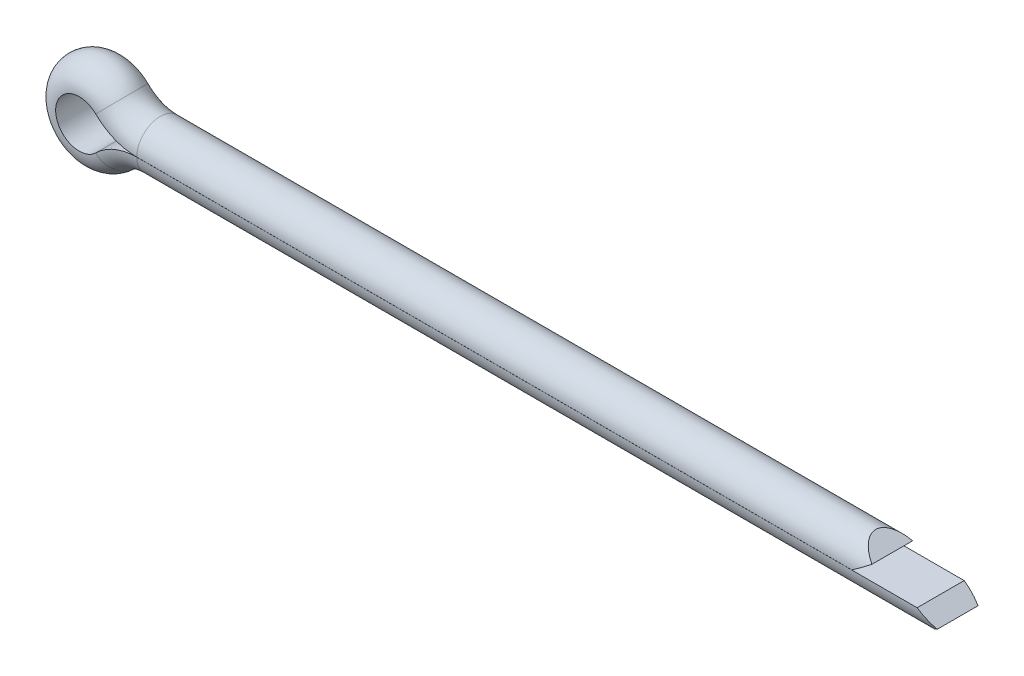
from build123d import *

# Parameters (mm, degrees)
CONECUT_DEPTH      = 31.566321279
CONECUT_DEPTH_BACK = 31.566321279


with BuildPart() as part:
    # Body: sweep along a path in PathSke
    with BuildLine(Plane.XY) as body_path:
        Line((28, 0.9), (0, 0.9))
        ThreePointArc((0, 0.9), (-0.50694731, 0.999684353), (-0.93840708, 1.283893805))
        ThreePointArc((-0.93840708, 1.283893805), (-4, 0), (-0.93840708, -1.283893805))
        ThreePointArc((-0.93840708, -1.283893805), (-0.50694731, -0.999684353), (0, -0.9))
        Line((0, -0.9), (30.5, -0.9))
    # SectionSke → Body (sweep)
    with BuildSketch(Plane(origin=(28, 0, 0), x_dir=(0, 0, -1), z_dir=(1, 0, 0))):
        with BuildLine():
            Line((-0.899997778, 0.002), (0.899997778, 0.002))
            ThreePointArc((0.899997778, 0.002), (0, 0.9), (-0.899997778, 0.002))
        make_face()
    sweep(path=body_path.line)

    # ConeCutSke → ConeCut (cut, two sides: drawn at the far end of the back side and taken through both)
    with BuildSketch(Plane.XY.offset(-CONECUT_DEPTH_BACK)):
        Polygon((28, 0.451), (27.352993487, 0.91), (30.51, 0.91), (30.51, -0.91), (29.852993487, -0.91), (30.5, -0.451), (29.847391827, 0), (27.347391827, 0), align=None)
    extrude(amount=CONECUT_DEPTH + CONECUT_DEPTH_BACK, mode=Mode.SUBTRACT)


solid = part.part
